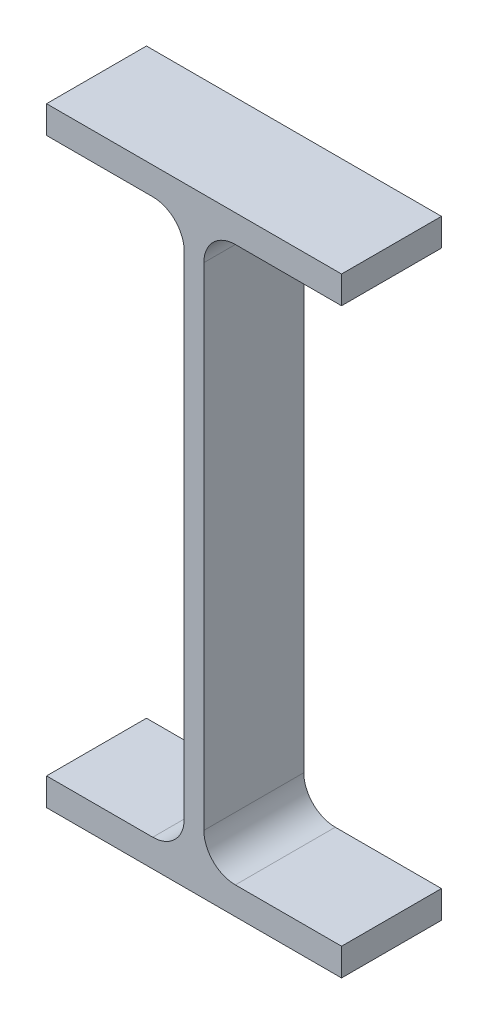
ISO-10303-21;
HEADER;
FILE_DESCRIPTION(('STEP AP214'),'2;1');
FILE_NAME('part.step','',(''),(''),'','','');
FILE_SCHEMA(('AUTOMOTIVE_DESIGN { 1 0 10303 214 1 1 1 1 }'));
ENDSEC;
DATA;
#1=APPLICATION_CONTEXT('core data for automotive mechanical design processes');
#2=APPLICATION_PROTOCOL_DEFINITION('international standard','automotive_design',2000,#1);
#3=PRODUCT_CONTEXT('',#1,'mechanical');
#4=PRODUCT('Part','Part','',(#3));
#5=PRODUCT_RELATED_PRODUCT_CATEGORY('part','',(#4));
#6=PRODUCT_DEFINITION_FORMATION('','',#4);
#7=PRODUCT_DEFINITION_CONTEXT('part definition',#1,'design');
#8=PRODUCT_DEFINITION('design','',#6,#7);
#9=PRODUCT_DEFINITION_SHAPE('','',#8);
#10=(LENGTH_UNIT() NAMED_UNIT(*) SI_UNIT(.MILLI.,.METRE.));
#11=(NAMED_UNIT(*) PLANE_ANGLE_UNIT() SI_UNIT($,.RADIAN.));
#12=(NAMED_UNIT(*) SI_UNIT($,.STERADIAN.) SOLID_ANGLE_UNIT());
#13=UNCERTAINTY_MEASURE_WITH_UNIT(LENGTH_MEASURE(1.E-05),#10,'distance_accuracy_value','');
#14=(GEOMETRIC_REPRESENTATION_CONTEXT(3) GLOBAL_UNCERTAINTY_ASSIGNED_CONTEXT((#13)) GLOBAL_UNIT_ASSIGNED_CONTEXT((#10,
#11,#12)) REPRESENTATION_CONTEXT('',''));
#15=CARTESIAN_POINT('',(0.,0.,0.));
#16=DIRECTION('',(0.,0.,1.));
#17=DIRECTION('',(1.,0.,0.));
#18=AXIS2_PLACEMENT_3D('',#15,#16,#17);
#19=CARTESIAN_POINT('',(-37.5,77.5,12.7));
#20=DIRECTION('',(1.,0.,0.));
#21=DIRECTION('',(0.,0.,-1.));
#22=AXIS2_PLACEMENT_3D('',#19,#20,#21);
#23=PLANE('',#22);
#24=DIRECTION('',(0.,-1.,0.));
#25=VECTOR('',#24,1.);
#26=CARTESIAN_POINT('',(-37.5,77.5,-12.7));
#27=LINE('',#26,#25);
#28=CARTESIAN_POINT('',(-37.5,77.5,-12.7));
#29=VERTEX_POINT('',#28);
#30=CARTESIAN_POINT('',(-37.5,70.5,-12.7));
#31=VERTEX_POINT('',#30);
#32=EDGE_CURVE('E182',#29,#31,#27,.T.);
#33=ORIENTED_EDGE('',*,*,#32,.T.);
#34=DIRECTION('',(0.,0.,-1.));
#35=VECTOR('',#34,1.);
#36=CARTESIAN_POINT('',(-37.5,70.5,12.7));
#37=LINE('',#36,#35);
#38=CARTESIAN_POINT('',(-37.5,70.5,12.7));
#39=VERTEX_POINT('',#38);
#40=EDGE_CURVE('E11',#39,#31,#37,.T.);
#41=ORIENTED_EDGE('',*,*,#40,.F.);
#42=DIRECTION('',(0.,-1.,0.));
#43=VECTOR('',#42,1.);
#44=CARTESIAN_POINT('',(-37.5,77.5,12.7));
#45=LINE('',#44,#43);
#46=CARTESIAN_POINT('',(-37.5,77.5,12.7));
#47=VERTEX_POINT('',#46);
#48=EDGE_CURVE('E214',#47,#39,#45,.T.);
#49=ORIENTED_EDGE('',*,*,#48,.F.);
#50=DIRECTION('',(0.,0.,-1.));
#51=VECTOR('',#50,1.);
#52=CARTESIAN_POINT('',(-37.5,77.5,12.7));
#53=LINE('',#52,#51);
#54=EDGE_CURVE('E177',#47,#29,#53,.T.);
#55=ORIENTED_EDGE('',*,*,#54,.T.);
#56=EDGE_LOOP('',(#33,#41,#49,#55));
#57=FACE_BOUND('',#56,.T.);
#58=ADVANCED_FACE('F39',(#57),#23,.F.);
#59=CARTESIAN_POINT('',(-37.5,70.5,12.7));
#60=DIRECTION('',(0.,1.,0.));
#61=DIRECTION('',(0.,0.,1.));
#62=AXIS2_PLACEMENT_3D('',#59,#60,#61);
#63=PLANE('',#62);
#64=DIRECTION('',(1.,0.,0.));
#65=VECTOR('',#64,1.);
#66=CARTESIAN_POINT('',(-37.5,70.5,-12.7));
#67=LINE('',#66,#65);
#68=CARTESIAN_POINT('',(-10.5,70.5,-12.7));
#69=VERTEX_POINT('',#68);
#70=EDGE_CURVE('E187',#31,#69,#67,.T.);
#71=ORIENTED_EDGE('',*,*,#70,.T.);
#72=DIRECTION('',(0.,0.,-1.));
#73=VECTOR('',#72,1.);
#74=CARTESIAN_POINT('',(-10.5,70.5,12.7));
#75=LINE('',#74,#73);
#76=CARTESIAN_POINT('',(-10.5,70.5,12.7));
#77=VERTEX_POINT('',#76);
#78=EDGE_CURVE('E50',#77,#69,#75,.T.);
#79=ORIENTED_EDGE('',*,*,#78,.F.);
#80=DIRECTION('',(1.,0.,0.));
#81=VECTOR('',#80,1.);
#82=CARTESIAN_POINT('',(-37.5,70.5,12.7));
#83=LINE('',#82,#81);
#84=EDGE_CURVE('E125',#39,#77,#83,.T.);
#85=ORIENTED_EDGE('',*,*,#84,.F.);
#86=ORIENTED_EDGE('',*,*,#40,.T.);
#87=EDGE_LOOP('',(#71,#79,#85,#86));
#88=FACE_BOUND('',#87,.T.);
#89=ADVANCED_FACE('F311',(#88),#63,.F.);
#90=CARTESIAN_POINT('',(-10.5,62.5,12.7));
#91=DIRECTION('',(0.,0.,-1.));
#92=DIRECTION('',(-1.,0.,0.));
#93=AXIS2_PLACEMENT_3D('',#90,#91,#92);
#94=CYLINDRICAL_SURFACE('',#93,8.);
#95=CARTESIAN_POINT('',(-10.5,62.5,-12.7));
#96=DIRECTION('',(0.,0.,-1.));
#97=DIRECTION('',(-1.,0.,0.));
#98=AXIS2_PLACEMENT_3D('',#95,#96,#97);
#99=CIRCLE('',#98,8.);
#100=CARTESIAN_POINT('',(-2.49999999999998,62.5,-12.7));
#101=VERTEX_POINT('',#100);
#102=EDGE_CURVE('E189',#69,#101,#99,.T.);
#103=ORIENTED_EDGE('',*,*,#102,.T.);
#104=DIRECTION('',(0.,0.,-1.));
#105=VECTOR('',#104,1.);
#106=CARTESIAN_POINT('',(-2.49999999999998,62.5,12.7));
#107=LINE('',#106,#105);
#108=CARTESIAN_POINT('',(-2.49999999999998,62.5,12.7));
#109=VERTEX_POINT('',#108);
#110=EDGE_CURVE('E242',#109,#101,#107,.T.);
#111=ORIENTED_EDGE('',*,*,#110,.F.);
#112=CARTESIAN_POINT('',(-10.5,62.5,12.7));
#113=DIRECTION('',(0.,0.,-1.));
#114=DIRECTION('',(-1.,0.,0.));
#115=AXIS2_PLACEMENT_3D('',#112,#113,#114);
#116=CIRCLE('',#115,8.);
#117=EDGE_CURVE('E255',#77,#109,#116,.T.);
#118=ORIENTED_EDGE('',*,*,#117,.F.);
#119=ORIENTED_EDGE('',*,*,#78,.T.);
#120=EDGE_LOOP('',(#103,#111,#118,#119));
#121=FACE_BOUND('',#120,.T.);
#122=ADVANCED_FACE('F249',(#121),#94,.F.);
#123=CARTESIAN_POINT('',(-2.49999999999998,62.5,12.7));
#124=DIRECTION('',(1.,0.,0.));
#125=DIRECTION('',(0.,0.,-1.));
#126=AXIS2_PLACEMENT_3D('',#123,#124,#125);
#127=PLANE('',#126);
#128=DIRECTION('',(0.,-1.,0.));
#129=VECTOR('',#128,1.);
#130=CARTESIAN_POINT('',(-2.49999999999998,62.5,-12.7));
#131=LINE('',#130,#129);
#132=CARTESIAN_POINT('',(-2.49999999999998,-62.5,-12.7));
#133=VERTEX_POINT('',#132);
#134=EDGE_CURVE('E188',#101,#133,#131,.T.);
#135=ORIENTED_EDGE('',*,*,#134,.T.);
#136=DIRECTION('',(0.,0.,-1.));
#137=VECTOR('',#136,1.);
#138=CARTESIAN_POINT('',(-2.49999999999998,-62.5,12.7));
#139=LINE('',#138,#137);
#140=CARTESIAN_POINT('',(-2.49999999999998,-62.5,12.7));
#141=VERTEX_POINT('',#140);
#142=EDGE_CURVE('E241',#141,#133,#139,.T.);
#143=ORIENTED_EDGE('',*,*,#142,.F.);
#144=DIRECTION('',(0.,-1.,0.));
#145=VECTOR('',#144,1.);
#146=CARTESIAN_POINT('',(-2.49999999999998,62.5,12.7));
#147=LINE('',#146,#145);
#148=EDGE_CURVE('E266',#109,#141,#147,.T.);
#149=ORIENTED_EDGE('',*,*,#148,.F.);
#150=ORIENTED_EDGE('',*,*,#110,.T.);
#151=EDGE_LOOP('',(#135,#143,#149,#150));
#152=FACE_BOUND('',#151,.T.);
#153=ADVANCED_FACE('F261',(#152),#127,.F.);
#154=CARTESIAN_POINT('',(-10.5,-62.5,12.7));
#155=DIRECTION('',(0.,0.,-1.));
#156=DIRECTION('',(-1.,0.,0.));
#157=AXIS2_PLACEMENT_3D('',#154,#155,#156);
#158=CYLINDRICAL_SURFACE('',#157,8.);
#159=CARTESIAN_POINT('',(-10.5,-62.5,-12.7));
#160=DIRECTION('',(0.,0.,-1.));
#161=DIRECTION('',(1.,0.,0.));
#162=AXIS2_PLACEMENT_3D('',#159,#160,#161);
#163=CIRCLE('',#162,8.);
#164=CARTESIAN_POINT('',(-10.5,-70.5,-12.7));
#165=VERTEX_POINT('',#164);
#166=EDGE_CURVE('E195',#133,#165,#163,.T.);
#167=ORIENTED_EDGE('',*,*,#166,.T.);
#168=DIRECTION('',(0.,0.,-1.));
#169=VECTOR('',#168,1.);
#170=CARTESIAN_POINT('',(-10.5,-70.5,12.7));
#171=LINE('',#170,#169);
#172=CARTESIAN_POINT('',(-10.5,-70.5,12.7));
#173=VERTEX_POINT('',#172);
#174=EDGE_CURVE('E238',#173,#165,#171,.T.);
#175=ORIENTED_EDGE('',*,*,#174,.F.);
#176=CARTESIAN_POINT('',(-10.5,-62.5,12.7));
#177=DIRECTION('',(0.,0.,-1.));
#178=DIRECTION('',(1.,0.,0.));
#179=AXIS2_PLACEMENT_3D('',#176,#177,#178);
#180=CIRCLE('',#179,8.);
#181=EDGE_CURVE('E270',#141,#173,#180,.T.);
#182=ORIENTED_EDGE('',*,*,#181,.F.);
#183=ORIENTED_EDGE('',*,*,#142,.T.);
#184=EDGE_LOOP('',(#167,#175,#182,#183));
#185=FACE_BOUND('',#184,.T.);
#186=ADVANCED_FACE('F265',(#185),#158,.F.);
#187=CARTESIAN_POINT('',(-37.5,-70.5,12.7));
#188=DIRECTION('',(0.,-1.,0.));
#189=DIRECTION('',(0.,0.,-1.));
#190=AXIS2_PLACEMENT_3D('',#187,#188,#189);
#191=PLANE('',#190);
#192=DIRECTION('',(-1.,0.,0.));
#193=VECTOR('',#192,1.);
#194=CARTESIAN_POINT('',(-37.5,-70.5,-12.7));
#195=LINE('',#194,#193);
#196=CARTESIAN_POINT('',(-37.5,-70.5,-12.7));
#197=VERTEX_POINT('',#196);
#198=EDGE_CURVE('E191',#165,#197,#195,.T.);
#199=ORIENTED_EDGE('',*,*,#198,.T.);
#200=DIRECTION('',(0.,0.,-1.));
#201=VECTOR('',#200,1.);
#202=CARTESIAN_POINT('',(-37.5,-70.5,12.7));
#203=LINE('',#202,#201);
#204=CARTESIAN_POINT('',(-37.5,-70.5,12.7));
#205=VERTEX_POINT('',#204);
#206=EDGE_CURVE('E232',#205,#197,#203,.T.);
#207=ORIENTED_EDGE('',*,*,#206,.F.);
#208=DIRECTION('',(-1.,0.,0.));
#209=VECTOR('',#208,1.);
#210=CARTESIAN_POINT('',(-37.5,-70.5,12.7));
#211=LINE('',#210,#209);
#212=EDGE_CURVE('E269',#173,#205,#211,.T.);
#213=ORIENTED_EDGE('',*,*,#212,.F.);
#214=ORIENTED_EDGE('',*,*,#174,.T.);
#215=EDGE_LOOP('',(#199,#207,#213,#214));
#216=FACE_BOUND('',#215,.T.);
#217=ADVANCED_FACE('F321',(#216),#191,.F.);
#218=CARTESIAN_POINT('',(-37.5,-70.5,12.7));
#219=DIRECTION('',(1.,0.,0.));
#220=DIRECTION('',(0.,0.,-1.));
#221=AXIS2_PLACEMENT_3D('',#218,#219,#220);
#222=PLANE('',#221);
#223=DIRECTION('',(0.,-1.,0.));
#224=VECTOR('',#223,1.);
#225=CARTESIAN_POINT('',(-37.5,-70.5,-12.7));
#226=LINE('',#225,#224);
#227=CARTESIAN_POINT('',(-37.5,-77.5,-12.7));
#228=VERTEX_POINT('',#227);
#229=EDGE_CURVE('E196',#197,#228,#226,.T.);
#230=ORIENTED_EDGE('',*,*,#229,.T.);
#231=DIRECTION('',(0.,0.,-1.));
#232=VECTOR('',#231,1.);
#233=CARTESIAN_POINT('',(-37.5,-77.5,12.7));
#234=LINE('',#233,#232);
#235=CARTESIAN_POINT('',(-37.5,-77.5,12.7));
#236=VERTEX_POINT('',#235);
#237=EDGE_CURVE('E235',#236,#228,#234,.T.);
#238=ORIENTED_EDGE('',*,*,#237,.F.);
#239=DIRECTION('',(0.,-1.,0.));
#240=VECTOR('',#239,1.);
#241=CARTESIAN_POINT('',(-37.5,-70.5,12.7));
#242=LINE('',#241,#240);
#243=EDGE_CURVE('E275',#205,#236,#242,.T.);
#244=ORIENTED_EDGE('',*,*,#243,.F.);
#245=ORIENTED_EDGE('',*,*,#206,.T.);
#246=EDGE_LOOP('',(#230,#238,#244,#245));
#247=FACE_BOUND('',#246,.T.);
#248=ADVANCED_FACE('F327',(#247),#222,.F.);
#249=CARTESIAN_POINT('',(-37.5,-77.5,12.7));
#250=DIRECTION('',(0.,1.,0.));
#251=DIRECTION('',(-1.,0.,0.));
#252=AXIS2_PLACEMENT_3D('',#249,#250,#251);
#253=PLANE('',#252);
#254=DIRECTION('',(1.,0.,0.));
#255=VECTOR('',#254,1.);
#256=CARTESIAN_POINT('',(-37.5,-77.5,-12.7));
#257=LINE('',#256,#255);
#258=CARTESIAN_POINT('',(37.5,-77.5,-12.7));
#259=VERTEX_POINT('',#258);
#260=EDGE_CURVE('E199',#228,#259,#257,.T.);
#261=ORIENTED_EDGE('',*,*,#260,.T.);
#262=DIRECTION('',(0.,0.,-1.));
#263=VECTOR('',#262,1.);
#264=CARTESIAN_POINT('',(37.5,-77.5,12.7));
#265=LINE('',#264,#263);
#266=CARTESIAN_POINT('',(37.5,-77.5,12.7));
#267=VERTEX_POINT('',#266);
#268=EDGE_CURVE('E230',#267,#259,#265,.T.);
#269=ORIENTED_EDGE('',*,*,#268,.F.);
#270=DIRECTION('',(1.,0.,0.));
#271=VECTOR('',#270,1.);
#272=CARTESIAN_POINT('',(-37.5,-77.5,12.7));
#273=LINE('',#272,#271);
#274=EDGE_CURVE('E279',#236,#267,#273,.T.);
#275=ORIENTED_EDGE('',*,*,#274,.F.);
#276=ORIENTED_EDGE('',*,*,#237,.T.);
#277=EDGE_LOOP('',(#261,#269,#275,#276));
#278=FACE_BOUND('',#277,.T.);
#279=ADVANCED_FACE('F332',(#278),#253,.F.);
#280=CARTESIAN_POINT('',(37.5,-70.5,12.7));
#281=DIRECTION('',(-1.,0.,0.));
#282=DIRECTION('',(0.,0.,1.));
#283=AXIS2_PLACEMENT_3D('',#280,#281,#282);
#284=PLANE('',#283);
#285=DIRECTION('',(0.,1.,0.));
#286=VECTOR('',#285,1.);
#287=CARTESIAN_POINT('',(37.5,-70.5,-12.7));
#288=LINE('',#287,#286);
#289=CARTESIAN_POINT('',(37.5,-70.5,-12.7));
#290=VERTEX_POINT('',#289);
#291=EDGE_CURVE('E200',#259,#290,#288,.T.);
#292=ORIENTED_EDGE('',*,*,#291,.T.);
#293=DIRECTION('',(0.,0.,-1.));
#294=VECTOR('',#293,1.);
#295=CARTESIAN_POINT('',(37.5,-70.5,12.7));
#296=LINE('',#295,#294);
#297=CARTESIAN_POINT('',(37.5,-70.5,12.7));
#298=VERTEX_POINT('',#297);
#299=EDGE_CURVE('E228',#298,#290,#296,.T.);
#300=ORIENTED_EDGE('',*,*,#299,.F.);
#301=DIRECTION('',(0.,1.,0.));
#302=VECTOR('',#301,1.);
#303=CARTESIAN_POINT('',(37.5,-70.5,12.7));
#304=LINE('',#303,#302);
#305=EDGE_CURVE('E278',#267,#298,#304,.T.);
#306=ORIENTED_EDGE('',*,*,#305,.F.);
#307=ORIENTED_EDGE('',*,*,#268,.T.);
#308=EDGE_LOOP('',(#292,#300,#306,#307));
#309=FACE_BOUND('',#308,.T.);
#310=ADVANCED_FACE('F331',(#309),#284,.F.);
#311=CARTESIAN_POINT('',(37.5,-70.5,12.7));
#312=DIRECTION('',(0.,-1.,0.));
#313=DIRECTION('',(1.,0.,0.));
#314=AXIS2_PLACEMENT_3D('',#311,#312,#313);
#315=PLANE('',#314);
#316=DIRECTION('',(-1.,0.,0.));
#317=VECTOR('',#316,1.);
#318=CARTESIAN_POINT('',(37.5,-70.5,-12.7));
#319=LINE('',#318,#317);
#320=CARTESIAN_POINT('',(10.5,-70.5,-12.7));
#321=VERTEX_POINT('',#320);
#322=EDGE_CURVE('E205',#290,#321,#319,.T.);
#323=ORIENTED_EDGE('',*,*,#322,.T.);
#324=DIRECTION('',(0.,0.,-1.));
#325=VECTOR('',#324,1.);
#326=CARTESIAN_POINT('',(10.5,-70.5,12.7));
#327=LINE('',#326,#325);
#328=CARTESIAN_POINT('',(10.5,-70.5,12.7));
#329=VERTEX_POINT('',#328);
#330=EDGE_CURVE('E223',#329,#321,#327,.T.);
#331=ORIENTED_EDGE('',*,*,#330,.F.);
#332=DIRECTION('',(-1.,0.,0.));
#333=VECTOR('',#332,1.);
#334=CARTESIAN_POINT('',(37.5,-70.5,12.7));
#335=LINE('',#334,#333);
#336=EDGE_CURVE('E282',#298,#329,#335,.T.);
#337=ORIENTED_EDGE('',*,*,#336,.F.);
#338=ORIENTED_EDGE('',*,*,#299,.T.);
#339=EDGE_LOOP('',(#323,#331,#337,#338));
#340=FACE_BOUND('',#339,.T.);
#341=ADVANCED_FACE('F339',(#340),#315,.F.);
#342=CARTESIAN_POINT('',(10.5,-62.5,12.7));
#343=DIRECTION('',(0.,0.,-1.));
#344=DIRECTION('',(-1.,0.,0.));
#345=AXIS2_PLACEMENT_3D('',#342,#343,#344);
#346=CYLINDRICAL_SURFACE('',#345,8.);
#347=CARTESIAN_POINT('',(10.5,-62.5,-12.7));
#348=DIRECTION('',(0.,0.,-1.));
#349=DIRECTION('',(-1.,0.,0.));
#350=AXIS2_PLACEMENT_3D('',#347,#348,#349);
#351=CIRCLE('',#350,8.);
#352=CARTESIAN_POINT('',(2.49999999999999,-62.5,-12.7));
#353=VERTEX_POINT('',#352);
#354=EDGE_CURVE('E204',#321,#353,#351,.T.);
#355=ORIENTED_EDGE('',*,*,#354,.T.);
#356=DIRECTION('',(0.,0.,-1.));
#357=VECTOR('',#356,1.);
#358=CARTESIAN_POINT('',(2.49999999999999,-62.5,12.7));
#359=LINE('',#358,#357);
#360=CARTESIAN_POINT('',(2.49999999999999,-62.5,12.7));
#361=VERTEX_POINT('',#360);
#362=EDGE_CURVE('E220',#361,#353,#359,.T.);
#363=ORIENTED_EDGE('',*,*,#362,.F.);
#364=CARTESIAN_POINT('',(10.5,-62.5,12.7));
#365=DIRECTION('',(0.,0.,-1.));
#366=DIRECTION('',(-1.,0.,0.));
#367=AXIS2_PLACEMENT_3D('',#364,#365,#366);
#368=CIRCLE('',#367,8.);
#369=EDGE_CURVE('E283',#329,#361,#368,.T.);
#370=ORIENTED_EDGE('',*,*,#369,.F.);
#371=ORIENTED_EDGE('',*,*,#330,.T.);
#372=EDGE_LOOP('',(#355,#363,#370,#371));
#373=FACE_BOUND('',#372,.T.);
#374=ADVANCED_FACE('F344',(#373),#346,.F.);
#375=CARTESIAN_POINT('',(2.49999999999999,62.5,12.7));
#376=DIRECTION('',(-1.,0.,0.));
#377=DIRECTION('',(0.,0.,1.));
#378=AXIS2_PLACEMENT_3D('',#375,#376,#377);
#379=PLANE('',#378);
#380=DIRECTION('',(0.,1.,0.));
#381=VECTOR('',#380,1.);
#382=CARTESIAN_POINT('',(2.49999999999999,62.5,-12.7));
#383=LINE('',#382,#381);
#384=CARTESIAN_POINT('',(2.49999999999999,62.5,-12.7));
#385=VERTEX_POINT('',#384);
#386=EDGE_CURVE('E207',#353,#385,#383,.T.);
#387=ORIENTED_EDGE('',*,*,#386,.T.);
#388=DIRECTION('',(0.,0.,-1.));
#389=VECTOR('',#388,1.);
#390=CARTESIAN_POINT('',(2.49999999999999,62.5,12.7));
#391=LINE('',#390,#389);
#392=CARTESIAN_POINT('',(2.49999999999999,62.5,12.7));
#393=VERTEX_POINT('',#392);
#394=EDGE_CURVE('E217',#393,#385,#391,.T.);
#395=ORIENTED_EDGE('',*,*,#394,.F.);
#396=DIRECTION('',(0.,1.,0.));
#397=VECTOR('',#396,1.);
#398=CARTESIAN_POINT('',(2.49999999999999,62.5,12.7));
#399=LINE('',#398,#397);
#400=EDGE_CURVE('E287',#361,#393,#399,.T.);
#401=ORIENTED_EDGE('',*,*,#400,.F.);
#402=ORIENTED_EDGE('',*,*,#362,.T.);
#403=EDGE_LOOP('',(#387,#395,#401,#402));
#404=FACE_BOUND('',#403,.T.);
#405=ADVANCED_FACE('F292',(#404),#379,.F.);
#406=CARTESIAN_POINT('',(10.5,62.5,12.7));
#407=DIRECTION('',(0.,0.,-1.));
#408=DIRECTION('',(-1.,0.,0.));
#409=AXIS2_PLACEMENT_3D('',#406,#407,#408);
#410=CYLINDRICAL_SURFACE('',#409,8.);
#411=CARTESIAN_POINT('',(10.5,62.5,-12.7));
#412=DIRECTION('',(0.,0.,-1.));
#413=DIRECTION('',(1.,0.,0.));
#414=AXIS2_PLACEMENT_3D('',#411,#412,#413);
#415=CIRCLE('',#414,8.);
#416=CARTESIAN_POINT('',(10.5,70.5,-12.7));
#417=VERTEX_POINT('',#416);
#418=EDGE_CURVE('E206',#385,#417,#415,.T.);
#419=ORIENTED_EDGE('',*,*,#418,.T.);
#420=DIRECTION('',(0.,0.,-1.));
#421=VECTOR('',#420,1.);
#422=CARTESIAN_POINT('',(10.5,70.5,12.7));
#423=LINE('',#422,#421);
#424=CARTESIAN_POINT('',(10.5,70.5,12.7));
#425=VERTEX_POINT('',#424);
#426=EDGE_CURVE('E172',#425,#417,#423,.T.);
#427=ORIENTED_EDGE('',*,*,#426,.F.);
#428=CARTESIAN_POINT('',(10.5,62.5,12.7));
#429=DIRECTION('',(0.,0.,-1.));
#430=DIRECTION('',(1.,0.,0.));
#431=AXIS2_PLACEMENT_3D('',#428,#429,#430);
#432=CIRCLE('',#431,8.);
#433=EDGE_CURVE('E164',#393,#425,#432,.T.);
#434=ORIENTED_EDGE('',*,*,#433,.F.);
#435=ORIENTED_EDGE('',*,*,#394,.T.);
#436=EDGE_LOOP('',(#419,#427,#434,#435));
#437=FACE_BOUND('',#436,.T.);
#438=ADVANCED_FACE('F298',(#437),#410,.F.);
#439=CARTESIAN_POINT('',(37.5,70.5,12.7));
#440=DIRECTION('',(0.,1.,0.));
#441=DIRECTION('',(-1.,0.,0.));
#442=AXIS2_PLACEMENT_3D('',#439,#440,#441);
#443=PLANE('',#442);
#444=DIRECTION('',(1.,0.,0.));
#445=VECTOR('',#444,1.);
#446=CARTESIAN_POINT('',(37.5,70.5,-12.7));
#447=LINE('',#446,#445);
#448=CARTESIAN_POINT('',(37.5,70.5,-12.7));
#449=VERTEX_POINT('',#448);
#450=EDGE_CURVE('E173',#417,#449,#447,.T.);
#451=ORIENTED_EDGE('',*,*,#450,.T.);
#452=DIRECTION('',(0.,0.,-1.));
#453=VECTOR('',#452,1.);
#454=CARTESIAN_POINT('',(37.5,70.5,12.7));
#455=LINE('',#454,#453);
#456=CARTESIAN_POINT('',(37.5,70.5,12.7));
#457=VERTEX_POINT('',#456);
#458=EDGE_CURVE('E167',#457,#449,#455,.T.);
#459=ORIENTED_EDGE('',*,*,#458,.F.);
#460=DIRECTION('',(1.,0.,0.));
#461=VECTOR('',#460,1.);
#462=CARTESIAN_POINT('',(37.5,70.5,12.7));
#463=LINE('',#462,#461);
#464=EDGE_CURVE('E159',#425,#457,#463,.T.);
#465=ORIENTED_EDGE('',*,*,#464,.F.);
#466=ORIENTED_EDGE('',*,*,#426,.T.);
#467=EDGE_LOOP('',(#451,#459,#465,#466));
#468=FACE_BOUND('',#467,.T.);
#469=ADVANCED_FACE('F171',(#468),#443,.F.);
#470=CARTESIAN_POINT('',(37.5,77.5,12.7));
#471=DIRECTION('',(-1.,0.,0.));
#472=DIRECTION('',(0.,0.,1.));
#473=AXIS2_PLACEMENT_3D('',#470,#471,#472);
#474=PLANE('',#473);
#475=DIRECTION('',(0.,1.,0.));
#476=VECTOR('',#475,1.);
#477=CARTESIAN_POINT('',(37.5,77.5,-12.7));
#478=LINE('',#477,#476);
#479=CARTESIAN_POINT('',(37.5,77.5,-12.7));
#480=VERTEX_POINT('',#479);
#481=EDGE_CURVE('E108',#449,#480,#478,.T.);
#482=ORIENTED_EDGE('',*,*,#481,.T.);
#483=DIRECTION('',(0.,0.,-1.));
#484=VECTOR('',#483,1.);
#485=CARTESIAN_POINT('',(37.5,77.5,12.7));
#486=LINE('',#485,#484);
#487=CARTESIAN_POINT('',(37.5,77.5,12.7));
#488=VERTEX_POINT('',#487);
#489=EDGE_CURVE('E174',#488,#480,#486,.T.);
#490=ORIENTED_EDGE('',*,*,#489,.F.);
#491=DIRECTION('',(0.,1.,0.));
#492=VECTOR('',#491,1.);
#493=CARTESIAN_POINT('',(37.5,77.5,12.7));
#494=LINE('',#493,#492);
#495=EDGE_CURVE('E161',#457,#488,#494,.T.);
#496=ORIENTED_EDGE('',*,*,#495,.F.);
#497=ORIENTED_EDGE('',*,*,#458,.T.);
#498=EDGE_LOOP('',(#482,#490,#496,#497));
#499=FACE_BOUND('',#498,.T.);
#500=ADVANCED_FACE('F180',(#499),#474,.F.);
#501=CARTESIAN_POINT('',(-37.5,77.5,12.7));
#502=DIRECTION('',(0.,-1.,0.));
#503=DIRECTION('',(1.,0.,0.));
#504=AXIS2_PLACEMENT_3D('',#501,#502,#503);
#505=PLANE('',#504);
#506=DIRECTION('',(-1.,0.,0.));
#507=VECTOR('',#506,1.);
#508=CARTESIAN_POINT('',(-37.5,77.5,-12.7));
#509=LINE('',#508,#507);
#510=EDGE_CURVE('E112',#480,#29,#509,.T.);
#511=ORIENTED_EDGE('',*,*,#510,.T.);
#512=ORIENTED_EDGE('',*,*,#54,.F.);
#513=DIRECTION('',(-1.,0.,0.));
#514=VECTOR('',#513,1.);
#515=CARTESIAN_POINT('',(-37.5,77.5,12.7));
#516=LINE('',#515,#514);
#517=EDGE_CURVE('E54',#488,#47,#516,.T.);
#518=ORIENTED_EDGE('',*,*,#517,.F.);
#519=ORIENTED_EDGE('',*,*,#489,.T.);
#520=EDGE_LOOP('',(#511,#512,#518,#519));
#521=FACE_BOUND('',#520,.T.);
#522=ADVANCED_FACE('F297',(#521),#505,.F.);
#523=CARTESIAN_POINT('',(-10.5,62.5,12.7));
#524=DIRECTION('',(0.,0.,-1.));
#525=DIRECTION('',(-1.,0.,0.));
#526=AXIS2_PLACEMENT_3D('',#523,#524,#525);
#527=PLANE('',#526);
#528=ORIENTED_EDGE('',*,*,#48,.T.);
#529=ORIENTED_EDGE('',*,*,#84,.T.);
#530=ORIENTED_EDGE('',*,*,#117,.T.);
#531=ORIENTED_EDGE('',*,*,#148,.T.);
#532=ORIENTED_EDGE('',*,*,#181,.T.);
#533=ORIENTED_EDGE('',*,*,#212,.T.);
#534=ORIENTED_EDGE('',*,*,#243,.T.);
#535=ORIENTED_EDGE('',*,*,#274,.T.);
#536=ORIENTED_EDGE('',*,*,#305,.T.);
#537=ORIENTED_EDGE('',*,*,#336,.T.);
#538=ORIENTED_EDGE('',*,*,#369,.T.);
#539=ORIENTED_EDGE('',*,*,#400,.T.);
#540=ORIENTED_EDGE('',*,*,#433,.T.);
#541=ORIENTED_EDGE('',*,*,#464,.T.);
#542=ORIENTED_EDGE('',*,*,#495,.T.);
#543=ORIENTED_EDGE('',*,*,#517,.T.);
#544=EDGE_LOOP('',(#528,#529,#530,#531,#532,#533,#534,#535,#536,#537,#538,#539,#540,#541,#542,#543));
#545=FACE_BOUND('',#544,.T.);
#546=ADVANCED_FACE('F163',(#545),#527,.F.);
#547=CARTESIAN_POINT('',(-10.5,62.5,-12.7));
#548=DIRECTION('',(0.,0.,-1.));
#549=DIRECTION('',(-1.,0.,0.));
#550=AXIS2_PLACEMENT_3D('',#547,#548,#549);
#551=PLANE('',#550);
#552=ORIENTED_EDGE('',*,*,#32,.F.);
#553=ORIENTED_EDGE('',*,*,#510,.F.);
#554=ORIENTED_EDGE('',*,*,#481,.F.);
#555=ORIENTED_EDGE('',*,*,#450,.F.);
#556=ORIENTED_EDGE('',*,*,#418,.F.);
#557=ORIENTED_EDGE('',*,*,#386,.F.);
#558=ORIENTED_EDGE('',*,*,#354,.F.);
#559=ORIENTED_EDGE('',*,*,#322,.F.);
#560=ORIENTED_EDGE('',*,*,#291,.F.);
#561=ORIENTED_EDGE('',*,*,#260,.F.);
#562=ORIENTED_EDGE('',*,*,#229,.F.);
#563=ORIENTED_EDGE('',*,*,#198,.F.);
#564=ORIENTED_EDGE('',*,*,#166,.F.);
#565=ORIENTED_EDGE('',*,*,#134,.F.);
#566=ORIENTED_EDGE('',*,*,#102,.F.);
#567=ORIENTED_EDGE('',*,*,#70,.F.);
#568=EDGE_LOOP('',(#552,#553,#554,#555,#556,#557,#558,#559,#560,#561,#562,#563,#564,#565,#566,#567));
#569=FACE_BOUND('',#568,.T.);
#570=ADVANCED_FACE('F257',(#569),#551,.T.);
#571=CLOSED_SHELL('',(#58,#89,#122,#153,#186,#217,#248,#279,#310,#341,#374,#405,#438,#469,#500,
#522,#546,#570));
#572=MANIFOLD_SOLID_BREP('B2',#571);
#573=ADVANCED_BREP_SHAPE_REPRESENTATION('',(#18,#572),#14);
#574=SHAPE_DEFINITION_REPRESENTATION(#9,#573);
ENDSEC;
END-ISO-10303-21;
